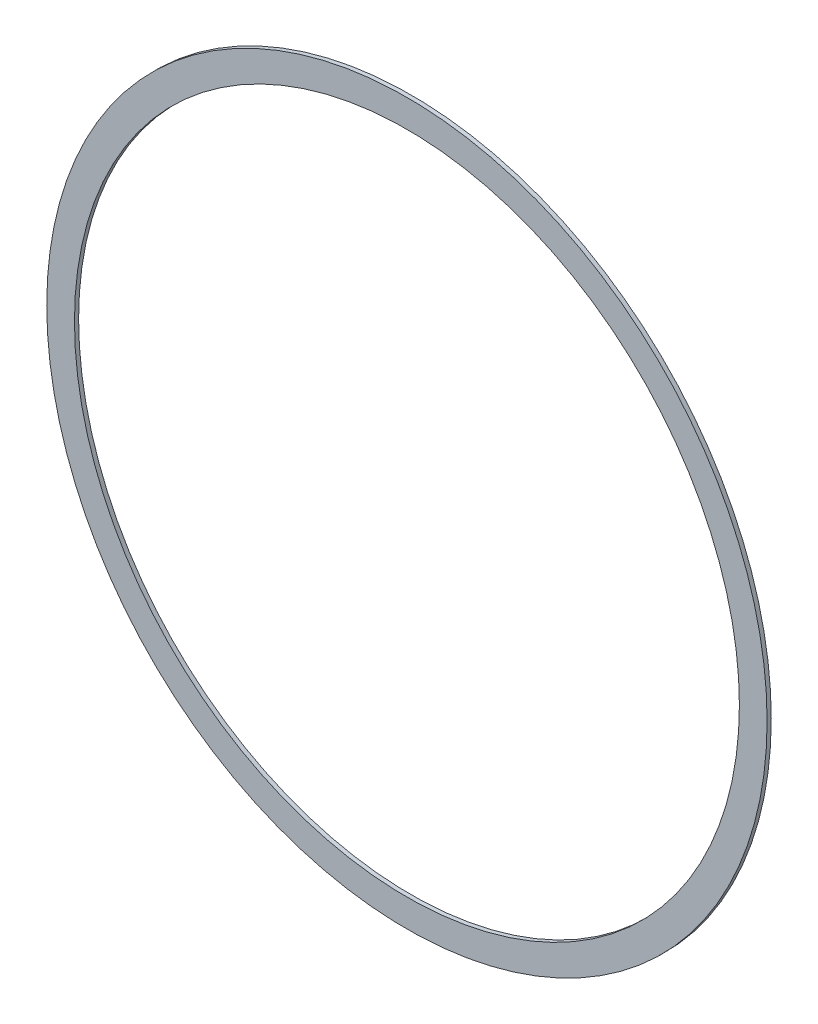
ISO-10303-21;
HEADER;
FILE_DESCRIPTION(('STEP AP214'),'2;1');
FILE_NAME('part.step','',(''),(''),'','','');
FILE_SCHEMA(('AUTOMOTIVE_DESIGN { 1 0 10303 214 1 1 1 1 }'));
ENDSEC;
DATA;
#1=APPLICATION_CONTEXT('core data for automotive mechanical design processes');
#2=APPLICATION_PROTOCOL_DEFINITION('international standard','automotive_design',2000,#1);
#3=PRODUCT_CONTEXT('',#1,'mechanical');
#4=PRODUCT('Part','Part','',(#3));
#5=PRODUCT_RELATED_PRODUCT_CATEGORY('part','',(#4));
#6=PRODUCT_DEFINITION_FORMATION('','',#4);
#7=PRODUCT_DEFINITION_CONTEXT('part definition',#1,'design');
#8=PRODUCT_DEFINITION('design','',#6,#7);
#9=PRODUCT_DEFINITION_SHAPE('','',#8);
#10=(LENGTH_UNIT() NAMED_UNIT(*) SI_UNIT(.MILLI.,.METRE.));
#11=(NAMED_UNIT(*) PLANE_ANGLE_UNIT() SI_UNIT($,.RADIAN.));
#12=(NAMED_UNIT(*) SI_UNIT($,.STERADIAN.) SOLID_ANGLE_UNIT());
#13=UNCERTAINTY_MEASURE_WITH_UNIT(LENGTH_MEASURE(1.E-05),#10,'distance_accuracy_value','');
#14=(GEOMETRIC_REPRESENTATION_CONTEXT(3) GLOBAL_UNCERTAINTY_ASSIGNED_CONTEXT((#13)) GLOBAL_UNIT_ASSIGNED_CONTEXT((#10,
#11,#12)) REPRESENTATION_CONTEXT('',''));
#15=CARTESIAN_POINT('',(0.,0.,0.));
#16=DIRECTION('',(0.,0.,1.));
#17=DIRECTION('',(1.,0.,0.));
#18=AXIS2_PLACEMENT_3D('',#15,#16,#17);
#19=CARTESIAN_POINT('',(0.,0.,19.05));
#20=DIRECTION('',(0.,0.,1.));
#21=DIRECTION('',(1.,0.,0.));
#22=AXIS2_PLACEMENT_3D('',#19,#20,#21);
#23=PLANE('',#22);
#24=CARTESIAN_POINT('',(0.,0.,19.05));
#25=DIRECTION('',(0.,0.,1.));
#26=DIRECTION('',(1.,0.,0.));
#27=AXIS2_PLACEMENT_3D('',#24,#25,#26);
#28=CIRCLE('',#27,1651.);
#29=CARTESIAN_POINT('',(-1651.,0.,19.05));
#30=VERTEX_POINT('',#29);
#31=EDGE_CURVE('E10',#30,#30,#28,.T.);
#32=ORIENTED_EDGE('',*,*,#31,.T.);
#33=EDGE_LOOP('',(#32));
#34=FACE_BOUND('',#33,.T.);
#35=CARTESIAN_POINT('',(0.,0.,19.05));
#36=DIRECTION('',(0.,0.,1.));
#37=DIRECTION('',(1.,0.,0.));
#38=AXIS2_PLACEMENT_3D('',#35,#36,#37);
#39=CIRCLE('',#38,1524.);
#40=CARTESIAN_POINT('',(-1524.,0.,19.05));
#41=VERTEX_POINT('',#40);
#42=EDGE_CURVE('E42',#41,#41,#39,.T.);
#43=ORIENTED_EDGE('',*,*,#42,.F.);
#44=EDGE_LOOP('',(#43));
#45=FACE_BOUND('',#44,.T.);
#46=ADVANCED_FACE('F31',(#34,#45),#23,.T.);
#47=CARTESIAN_POINT('',(0.,0.,0.));
#48=DIRECTION('',(0.,0.,1.));
#49=DIRECTION('',(1.,0.,0.));
#50=AXIS2_PLACEMENT_3D('',#47,#48,#49);
#51=PLANE('',#50);
#52=CARTESIAN_POINT('',(0.,0.,0.));
#53=DIRECTION('',(0.,0.,1.));
#54=DIRECTION('',(1.,0.,0.));
#55=AXIS2_PLACEMENT_3D('',#52,#53,#54);
#56=CIRCLE('',#55,1651.);
#57=CARTESIAN_POINT('',(-1651.,0.,0.));
#58=VERTEX_POINT('',#57);
#59=EDGE_CURVE('E35',#58,#58,#56,.T.);
#60=ORIENTED_EDGE('',*,*,#59,.F.);
#61=EDGE_LOOP('',(#60));
#62=FACE_BOUND('',#61,.T.);
#63=CARTESIAN_POINT('',(0.,0.,0.));
#64=DIRECTION('',(0.,0.,1.));
#65=DIRECTION('',(1.,0.,0.));
#66=AXIS2_PLACEMENT_3D('',#63,#64,#65);
#67=CIRCLE('',#66,1524.);
#68=CARTESIAN_POINT('',(-1524.,0.,0.));
#69=VERTEX_POINT('',#68);
#70=EDGE_CURVE('E44',#69,#69,#67,.T.);
#71=ORIENTED_EDGE('',*,*,#70,.T.);
#72=EDGE_LOOP('',(#71));
#73=FACE_BOUND('',#72,.T.);
#74=ADVANCED_FACE('F54',(#62,#73),#51,.F.);
#75=CARTESIAN_POINT('',(0.,0.,19.05));
#76=DIRECTION('',(0.,0.,-1.));
#77=DIRECTION('',(-1.,0.,0.));
#78=AXIS2_PLACEMENT_3D('',#75,#76,#77);
#79=CYLINDRICAL_SURFACE('',#78,1651.);
#80=CARTESIAN_POINT('',(-1651.,0.,19.05));
#81=CARTESIAN_POINT('',(-1651.,0.,18.8515625));
#82=CARTESIAN_POINT('',(-1651.,0.,18.653125));
#83=CARTESIAN_POINT('',(-1651.,0.,18.25625));
#84=CARTESIAN_POINT('',(-1651.,0.,18.0578125));
#85=CARTESIAN_POINT('',(-1651.,0.,17.6609375));
#86=CARTESIAN_POINT('',(-1651.,0.,17.4625));
#87=CARTESIAN_POINT('',(-1651.,0.,17.065625));
#88=CARTESIAN_POINT('',(-1651.,0.,16.8671875));
#89=CARTESIAN_POINT('',(-1651.,0.,16.4703125));
#90=CARTESIAN_POINT('',(-1651.,0.,16.271875));
#91=CARTESIAN_POINT('',(-1651.,0.,15.875));
#92=CARTESIAN_POINT('',(-1651.,0.,15.6765625));
#93=CARTESIAN_POINT('',(-1651.,0.,15.2796875));
#94=CARTESIAN_POINT('',(-1651.,0.,15.08125));
#95=CARTESIAN_POINT('',(-1651.,0.,14.684375));
#96=CARTESIAN_POINT('',(-1651.,0.,14.4859375));
#97=CARTESIAN_POINT('',(-1651.,0.,14.0890625));
#98=CARTESIAN_POINT('',(-1651.,0.,13.890625));
#99=CARTESIAN_POINT('',(-1651.,0.,13.49375));
#100=CARTESIAN_POINT('',(-1651.,0.,13.2953125));
#101=CARTESIAN_POINT('',(-1651.,0.,12.8984375));
#102=CARTESIAN_POINT('',(-1651.,0.,12.7));
#103=CARTESIAN_POINT('',(-1651.,0.,12.303125));
#104=CARTESIAN_POINT('',(-1651.,0.,12.1046875));
#105=CARTESIAN_POINT('',(-1651.,0.,11.7078125));
#106=CARTESIAN_POINT('',(-1651.,0.,11.509375));
#107=CARTESIAN_POINT('',(-1651.,0.,11.1125));
#108=CARTESIAN_POINT('',(-1651.,0.,10.9140625));
#109=CARTESIAN_POINT('',(-1651.,0.,10.5171875));
#110=CARTESIAN_POINT('',(-1651.,0.,10.31875));
#111=CARTESIAN_POINT('',(-1651.,0.,9.921875));
#112=CARTESIAN_POINT('',(-1651.,0.,9.7234375));
#113=CARTESIAN_POINT('',(-1651.,0.,9.3265625));
#114=CARTESIAN_POINT('',(-1651.,0.,9.128125));
#115=CARTESIAN_POINT('',(-1651.,0.,8.73125));
#116=CARTESIAN_POINT('',(-1651.,0.,8.5328125));
#117=CARTESIAN_POINT('',(-1651.,0.,8.1359375));
#118=CARTESIAN_POINT('',(-1651.,0.,7.9375));
#119=CARTESIAN_POINT('',(-1651.,0.,7.540625));
#120=CARTESIAN_POINT('',(-1651.,0.,7.3421875));
#121=CARTESIAN_POINT('',(-1651.,0.,6.9453125));
#122=CARTESIAN_POINT('',(-1651.,0.,6.746875));
#123=CARTESIAN_POINT('',(-1651.,0.,6.35));
#124=CARTESIAN_POINT('',(-1651.,0.,6.1515625));
#125=CARTESIAN_POINT('',(-1651.,0.,5.7546875));
#126=CARTESIAN_POINT('',(-1651.,0.,5.55625));
#127=CARTESIAN_POINT('',(-1651.,0.,5.159375));
#128=CARTESIAN_POINT('',(-1651.,0.,4.9609375));
#129=CARTESIAN_POINT('',(-1651.,0.,4.5640625));
#130=CARTESIAN_POINT('',(-1651.,0.,4.365625));
#131=CARTESIAN_POINT('',(-1651.,0.,3.96875));
#132=CARTESIAN_POINT('',(-1651.,0.,3.7703125));
#133=CARTESIAN_POINT('',(-1651.,0.,3.3734375));
#134=CARTESIAN_POINT('',(-1651.,0.,3.175));
#135=CARTESIAN_POINT('',(-1651.,0.,2.778125));
#136=CARTESIAN_POINT('',(-1651.,0.,2.5796875));
#137=CARTESIAN_POINT('',(-1651.,0.,2.1828125));
#138=CARTESIAN_POINT('',(-1651.,0.,1.984375));
#139=CARTESIAN_POINT('',(-1651.,0.,1.5875));
#140=CARTESIAN_POINT('',(-1651.,0.,1.3890625));
#141=CARTESIAN_POINT('',(-1651.,0.,0.992187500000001));
#142=CARTESIAN_POINT('',(-1651.,0.,0.793750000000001));
#143=CARTESIAN_POINT('',(-1651.,0.,0.396875));
#144=CARTESIAN_POINT('',(-1651.,0.,0.1984375));
#145=CARTESIAN_POINT('',(-1651.,0.,0.));
#146=B_SPLINE_CURVE_WITH_KNOTS('',3,(#80,#81,#82,#83,#84,#85,#86,#87,#88,#89,#90,#91,#92,#93,
#94,#95,#96,#97,#98,#99,#100,#101,#102,#103,#104,#105,#106,#107,#108,#109,#110,#111,#112,#113,
#114,#115,#116,#117,#118,#119,#120,#121,#122,#123,#124,#125,#126,#127,#128,#129,#130,#131,#132,
#133,#134,#135,#136,#137,#138,#139,#140,#141,#142,#143,#144,#145),.UNSPECIFIED.,.F.,.F.,(4,2,2,
2,2,2,2,2,2,2,2,2,2,2,2,2,2,2,2,2,2,2,2,2,2,2,2,2,2,2,2,2,4),(0.,0.595312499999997,1.190625,
1.7859375,2.38125,2.9765625,3.571875,4.1671875,4.7625,5.3578125,5.953125,6.5484375,7.14375,
7.7390625,8.334375,8.9296875,9.525,10.1203125,10.715625,11.3109375,11.90625,12.5015625,
13.096875,13.6921875,14.2875,14.8828125,15.478125,16.0734375,16.66875,17.2640625,17.859375,
18.4546875,19.05),.UNSPECIFIED.);
#147=EDGE_CURVE('BSEAM33',#30,#58,#146,.T.);
#148=ORIENTED_EDGE('',*,*,#31,.F.);
#149=ORIENTED_EDGE('',*,*,#59,.T.);
#150=ORIENTED_EDGE('',*,*,#147,.T.);
#151=ORIENTED_EDGE('',*,*,#147,.F.);
#152=EDGE_LOOP('',(#148,#150,#149,#151));
#153=FACE_BOUND('',#152,.T.);
#154=ADVANCED_FACE('F33',(#153),#79,.T.);
#155=CARTESIAN_POINT('',(0.,0.,19.05));
#156=DIRECTION('',(0.,0.,-1.));
#157=DIRECTION('',(-1.,0.,0.));
#158=AXIS2_PLACEMENT_3D('',#155,#156,#157);
#159=CYLINDRICAL_SURFACE('',#158,1524.);
#160=CARTESIAN_POINT('',(-1524.,0.,19.05));
#161=CARTESIAN_POINT('',(-1524.,0.,18.8515625));
#162=CARTESIAN_POINT('',(-1524.,0.,18.653125));
#163=CARTESIAN_POINT('',(-1524.,0.,18.25625));
#164=CARTESIAN_POINT('',(-1524.,0.,18.0578125));
#165=CARTESIAN_POINT('',(-1524.,0.,17.6609375));
#166=CARTESIAN_POINT('',(-1524.,0.,17.4625));
#167=CARTESIAN_POINT('',(-1524.,0.,17.065625));
#168=CARTESIAN_POINT('',(-1524.,0.,16.8671875));
#169=CARTESIAN_POINT('',(-1524.,0.,16.4703125));
#170=CARTESIAN_POINT('',(-1524.,0.,16.271875));
#171=CARTESIAN_POINT('',(-1524.,0.,15.875));
#172=CARTESIAN_POINT('',(-1524.,0.,15.6765625));
#173=CARTESIAN_POINT('',(-1524.,0.,15.2796875));
#174=CARTESIAN_POINT('',(-1524.,0.,15.08125));
#175=CARTESIAN_POINT('',(-1524.,0.,14.684375));
#176=CARTESIAN_POINT('',(-1524.,0.,14.4859375));
#177=CARTESIAN_POINT('',(-1524.,0.,14.0890625));
#178=CARTESIAN_POINT('',(-1524.,0.,13.890625));
#179=CARTESIAN_POINT('',(-1524.,0.,13.49375));
#180=CARTESIAN_POINT('',(-1524.,0.,13.2953125));
#181=CARTESIAN_POINT('',(-1524.,0.,12.8984375));
#182=CARTESIAN_POINT('',(-1524.,0.,12.7));
#183=CARTESIAN_POINT('',(-1524.,0.,12.303125));
#184=CARTESIAN_POINT('',(-1524.,0.,12.1046875));
#185=CARTESIAN_POINT('',(-1524.,0.,11.7078125));
#186=CARTESIAN_POINT('',(-1524.,0.,11.509375));
#187=CARTESIAN_POINT('',(-1524.,0.,11.1125));
#188=CARTESIAN_POINT('',(-1524.,0.,10.9140625));
#189=CARTESIAN_POINT('',(-1524.,0.,10.5171875));
#190=CARTESIAN_POINT('',(-1524.,0.,10.31875));
#191=CARTESIAN_POINT('',(-1524.,0.,9.921875));
#192=CARTESIAN_POINT('',(-1524.,0.,9.7234375));
#193=CARTESIAN_POINT('',(-1524.,0.,9.3265625));
#194=CARTESIAN_POINT('',(-1524.,0.,9.128125));
#195=CARTESIAN_POINT('',(-1524.,0.,8.73125));
#196=CARTESIAN_POINT('',(-1524.,0.,8.5328125));
#197=CARTESIAN_POINT('',(-1524.,0.,8.1359375));
#198=CARTESIAN_POINT('',(-1524.,0.,7.9375));
#199=CARTESIAN_POINT('',(-1524.,0.,7.540625));
#200=CARTESIAN_POINT('',(-1524.,0.,7.3421875));
#201=CARTESIAN_POINT('',(-1524.,0.,6.9453125));
#202=CARTESIAN_POINT('',(-1524.,0.,6.746875));
#203=CARTESIAN_POINT('',(-1524.,0.,6.35));
#204=CARTESIAN_POINT('',(-1524.,0.,6.1515625));
#205=CARTESIAN_POINT('',(-1524.,0.,5.7546875));
#206=CARTESIAN_POINT('',(-1524.,0.,5.55625));
#207=CARTESIAN_POINT('',(-1524.,0.,5.159375));
#208=CARTESIAN_POINT('',(-1524.,0.,4.9609375));
#209=CARTESIAN_POINT('',(-1524.,0.,4.5640625));
#210=CARTESIAN_POINT('',(-1524.,0.,4.365625));
#211=CARTESIAN_POINT('',(-1524.,0.,3.96875));
#212=CARTESIAN_POINT('',(-1524.,0.,3.7703125));
#213=CARTESIAN_POINT('',(-1524.,0.,3.3734375));
#214=CARTESIAN_POINT('',(-1524.,0.,3.175));
#215=CARTESIAN_POINT('',(-1524.,0.,2.778125));
#216=CARTESIAN_POINT('',(-1524.,0.,2.5796875));
#217=CARTESIAN_POINT('',(-1524.,0.,2.1828125));
#218=CARTESIAN_POINT('',(-1524.,0.,1.984375));
#219=CARTESIAN_POINT('',(-1524.,0.,1.5875));
#220=CARTESIAN_POINT('',(-1524.,0.,1.3890625));
#221=CARTESIAN_POINT('',(-1524.,0.,0.992187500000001));
#222=CARTESIAN_POINT('',(-1524.,0.,0.793750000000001));
#223=CARTESIAN_POINT('',(-1524.,0.,0.396875));
#224=CARTESIAN_POINT('',(-1524.,0.,0.1984375));
#225=CARTESIAN_POINT('',(-1524.,0.,0.));
#226=B_SPLINE_CURVE_WITH_KNOTS('',3,(#160,#161,#162,#163,#164,#165,#166,#167,#168,#169,#170,
#171,#172,#173,#174,#175,#176,#177,#178,#179,#180,#181,#182,#183,#184,#185,#186,#187,#188,#189,
#190,#191,#192,#193,#194,#195,#196,#197,#198,#199,#200,#201,#202,#203,#204,#205,#206,#207,#208,
#209,#210,#211,#212,#213,#214,#215,#216,#217,#218,#219,#220,#221,#222,#223,#224,#225),
.UNSPECIFIED.,.F.,.F.,(4,2,2,2,2,2,2,2,2,2,2,2,2,2,2,2,2,2,2,2,2,2,2,2,2,2,2,2,2,2,2,2,4),(0.,
0.595312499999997,1.190625,1.7859375,2.38125,2.9765625,3.571875,4.1671875,4.7625,5.3578125,
5.953125,6.5484375,7.14375,7.7390625,8.334375,8.9296875,9.525,10.1203125,10.715625,11.3109375,
11.90625,12.5015625,13.096875,13.6921875,14.2875,14.8828125,15.478125,16.0734375,16.66875,
17.2640625,17.859375,18.4546875,19.05),.UNSPECIFIED.);
#227=EDGE_CURVE('BSEAM50',#41,#69,#226,.T.);
#228=ORIENTED_EDGE('',*,*,#42,.T.);
#229=ORIENTED_EDGE('',*,*,#70,.F.);
#230=ORIENTED_EDGE('',*,*,#227,.T.);
#231=ORIENTED_EDGE('',*,*,#227,.F.);
#232=EDGE_LOOP('',(#228,#230,#229,#231));
#233=FACE_BOUND('',#232,.T.);
#234=ADVANCED_FACE('F50',(#233),#159,.F.);
#235=CLOSED_SHELL('',(#46,#74,#154,#234));
#236=MANIFOLD_SOLID_BREP('B2',#235);
#237=ADVANCED_BREP_SHAPE_REPRESENTATION('',(#18,#236),#14);
#238=SHAPE_DEFINITION_REPRESENTATION(#9,#237);
ENDSEC;
END-ISO-10303-21;
